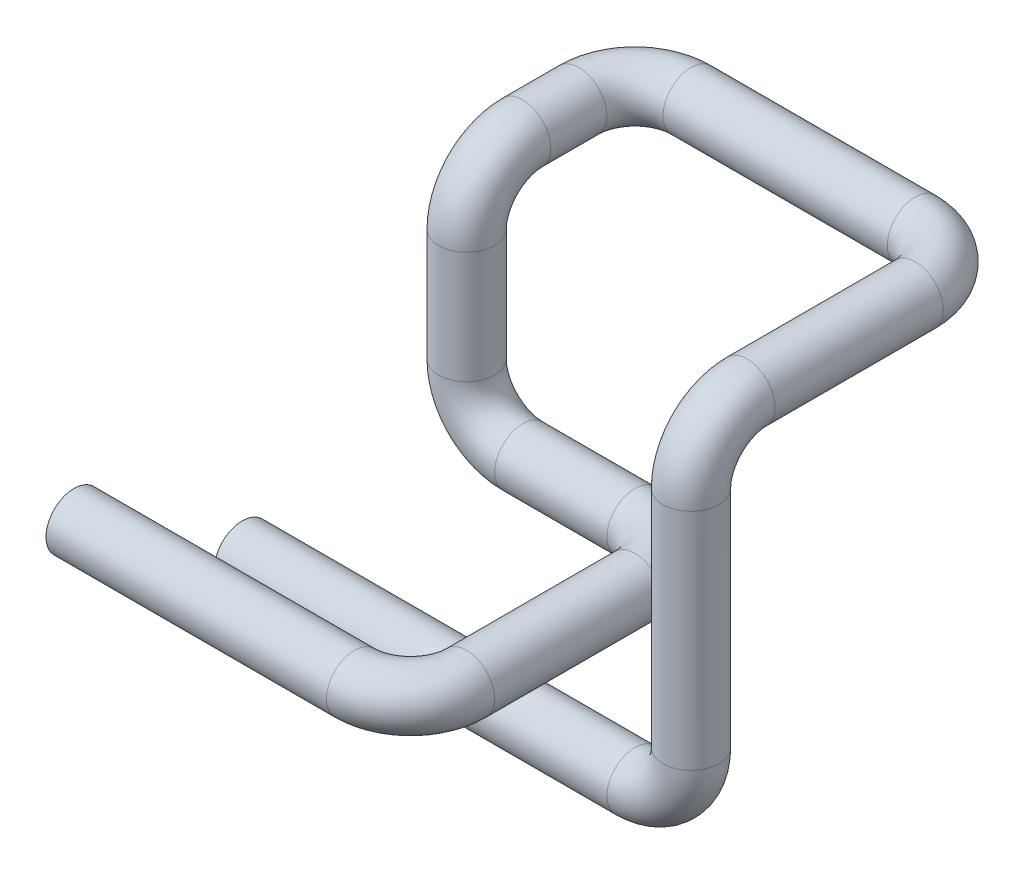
from build123d import *

# Parameters (mm, degrees)
SWEEP_THIN1_PROFILE_R   = 6.35
SWEEP_THIN1_PROFILE_R_2 = 5.08


with BuildPart() as part:
    # Sweep-Thin1: sweep along a curve in space
    with BuildLine() as sweep_thin1_path:
        Line((0, 0, 0), (88.9, 0, 0))
        ThreePointArc((88.9, 0, 0), (97.880256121, 3.719743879, 0), (101.6, 12.7, 0))
        Line((101.6, 12.7, 0), (101.6, 63.5, 0))
        ThreePointArc((101.6, 63.5, 0), (101.6, 72.480256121, -3.719743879), (101.6, 76.2, -12.7))
        Line((101.6, 76.2, -12.7), (101.6, 76.2, -50.8))
        ThreePointArc((101.6, 76.2, -50.8), (97.880256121, 76.2, -59.780256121), (88.9, 76.2, -63.5))
        Line((88.9, 76.2, -63.5), (38.1, 76.2, -63.5))
        ThreePointArc((38.1, 76.2, -63.5), (29.119743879, 76.2, -59.780256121), (25.4, 76.2, -50.8))
        Line((25.4, 76.2, -50.8), (25.4, 76.2, -38.1))
        ThreePointArc((25.4, 76.2, -38.1), (25.4, 72.480256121, -29.119743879), (25.4, 63.5, -25.4))
        Line((25.4, 63.5, -25.4), (25.4, 38.1, -25.4))
        ThreePointArc((25.4, 38.1, -25.4), (29.119743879, 29.119743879, -25.4), (38.1, 25.4, -25.4))
        Line((38.1, 25.4, -25.4), (63.5, 25.4, -25.4))
        ThreePointArc((63.5, 25.4, -25.4), (72.480256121, 25.4, -21.680256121), (76.2, 25.4, -12.7))
        Line((76.2, 25.4, -12.7), (76.2, 25.4, 25.4))
        ThreePointArc((76.2, 25.4, 25.4), (72.480256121, 25.4, 34.380256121), (63.5, 25.4, 38.1))
        Line((63.5, 25.4, 38.1), (0, 25.4, 38.1))
    # Sweep-Thin1 profile (on start of the path) → Sweep-Thin1 (sweep)
    with BuildSketch(Plane(origin=(0, 0, 0), x_dir=(0, 0, 1), z_dir=(1, 0, 0))):
        Circle(SWEEP_THIN1_PROFILE_R)
        Circle(SWEEP_THIN1_PROFILE_R_2, mode=Mode.SUBTRACT)
    sweep(path=sweep_thin1_path.line)


solid = part.part
